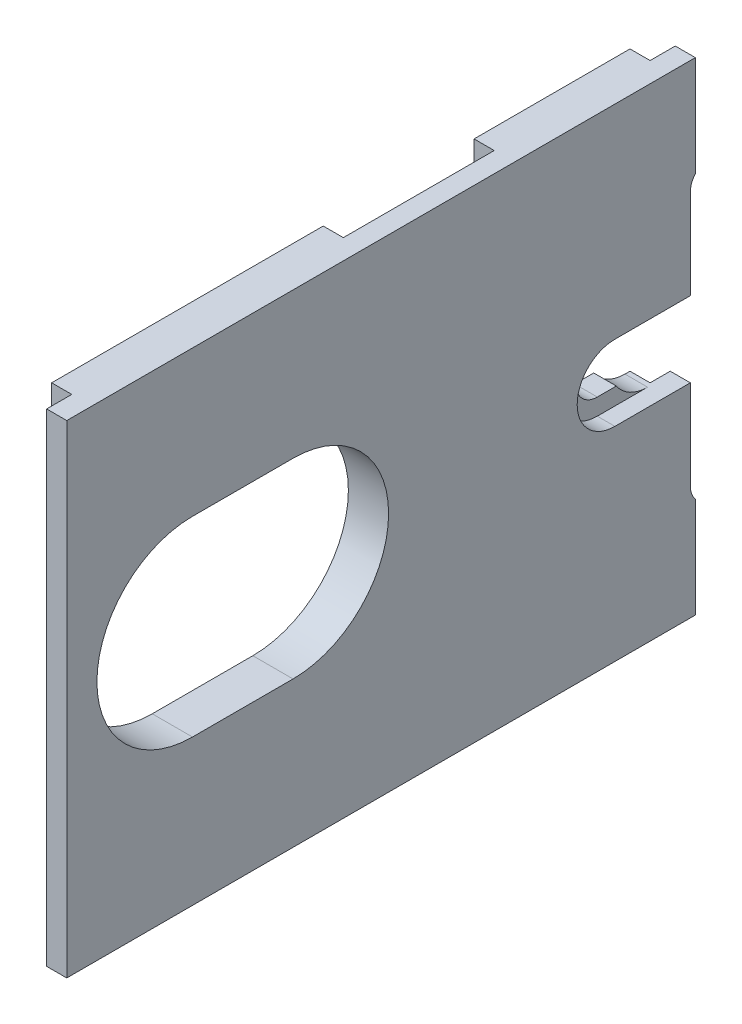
ISO-10303-21;
HEADER;
FILE_DESCRIPTION(('STEP AP214'),'2;1');
FILE_NAME('part.step','',(''),(''),'','','');
FILE_SCHEMA(('AUTOMOTIVE_DESIGN { 1 0 10303 214 1 1 1 1 }'));
ENDSEC;
DATA;
#1=APPLICATION_CONTEXT('core data for automotive mechanical design processes');
#2=APPLICATION_PROTOCOL_DEFINITION('international standard','automotive_design',2000,#1);
#3=PRODUCT_CONTEXT('',#1,'mechanical');
#4=PRODUCT('Part','Part','',(#3));
#5=PRODUCT_RELATED_PRODUCT_CATEGORY('part','',(#4));
#6=PRODUCT_DEFINITION_FORMATION('','',#4);
#7=PRODUCT_DEFINITION_CONTEXT('part definition',#1,'design');
#8=PRODUCT_DEFINITION('design','',#6,#7);
#9=PRODUCT_DEFINITION_SHAPE('','',#8);
#10=(LENGTH_UNIT() NAMED_UNIT(*) SI_UNIT(.MILLI.,.METRE.));
#11=(NAMED_UNIT(*) PLANE_ANGLE_UNIT() SI_UNIT($,.RADIAN.));
#12=(NAMED_UNIT(*) SI_UNIT($,.STERADIAN.) SOLID_ANGLE_UNIT());
#13=UNCERTAINTY_MEASURE_WITH_UNIT(LENGTH_MEASURE(1.E-05),#10,'distance_accuracy_value','');
#14=(GEOMETRIC_REPRESENTATION_CONTEXT(3) GLOBAL_UNCERTAINTY_ASSIGNED_CONTEXT((#13)) GLOBAL_UNIT_ASSIGNED_CONTEXT((#10,
#11,#12)) REPRESENTATION_CONTEXT('',''));
#15=CARTESIAN_POINT('',(0.,0.,0.));
#16=DIRECTION('',(0.,0.,1.));
#17=DIRECTION('',(1.,0.,0.));
#18=AXIS2_PLACEMENT_3D('',#15,#16,#17);
#19=CARTESIAN_POINT('',(71.5,25.354248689,-3.));
#20=DIRECTION('',(-1.,0.,0.));
#21=DIRECTION('',(0.,0.,1.));
#22=AXIS2_PLACEMENT_3D('',#19,#20,#21);
#23=CYLINDRICAL_SURFACE('',#22,4.);
#24=DIRECTION('',(-1.,0.,0.));
#25=VECTOR('',#24,1.);
#26=CARTESIAN_POINT('',(69.5,25.354248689,1.));
#27=LINE('',#26,#25);
#28=CARTESIAN_POINT('',(71.5,25.354248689,1.000000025));
#29=VERTEX_POINT('',#28);
#30=CARTESIAN_POINT('',(67.5,25.354248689,1.));
#31=VERTEX_POINT('',#30);
#32=EDGE_CURVE('E584',#29,#31,#27,.T.);
#33=ORIENTED_EDGE('',*,*,#32,.T.);
#34=CARTESIAN_POINT('',(67.5,25.354248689,-3.));
#35=DIRECTION('',(-1.,0.,0.));
#36=DIRECTION('',(0.,0.,1.));
#37=AXIS2_PLACEMENT_3D('',#34,#35,#36);
#38=CIRCLE('',#37,4.);
#39=CARTESIAN_POINT('',(67.5,28.0000000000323,0.));
#40=VERTEX_POINT('',#39);
#41=EDGE_CURVE('E348',#31,#40,#38,.T.);
#42=ORIENTED_EDGE('',*,*,#41,.T.);
#43=DIRECTION('',(1.,0.,0.));
#44=VECTOR('',#43,1.);
#45=CARTESIAN_POINT('',(69.5,28.,0.));
#46=LINE('',#45,#44);
#47=CARTESIAN_POINT('',(71.5,28.0000000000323,0.));
#48=VERTEX_POINT('',#47);
#49=EDGE_CURVE('E335',#40,#48,#46,.T.);
#50=ORIENTED_EDGE('',*,*,#49,.T.);
#51=CARTESIAN_POINT('',(71.5,25.354248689,-3.));
#52=DIRECTION('',(-1.,0.,0.));
#53=DIRECTION('',(0.,0.,1.));
#54=AXIS2_PLACEMENT_3D('',#51,#52,#53);
#55=CIRCLE('',#54,4.);
#56=EDGE_CURVE('E347',#29,#48,#55,.T.);
#57=ORIENTED_EDGE('',*,*,#56,.F.);
#58=EDGE_LOOP('',(#33,#42,#50,#57));
#59=FACE_BOUND('',#58,.T.);
#60=ADVANCED_FACE('F14',(#59),#23,.F.);
#61=CARTESIAN_POINT('',(71.5,-25.354248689,-3.));
#62=DIRECTION('',(-1.,0.,0.));
#63=DIRECTION('',(0.,0.,1.));
#64=AXIS2_PLACEMENT_3D('',#61,#62,#63);
#65=CYLINDRICAL_SURFACE('',#64,4.);
#66=DIRECTION('',(-1.,0.,0.));
#67=VECTOR('',#66,1.);
#68=CARTESIAN_POINT('',(69.5,-28.,0.));
#69=LINE('',#68,#67);
#70=CARTESIAN_POINT('',(71.5,-28.0000000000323,0.));
#71=VERTEX_POINT('',#70);
#72=CARTESIAN_POINT('',(67.5,-28.0000000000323,0.));
#73=VERTEX_POINT('',#72);
#74=EDGE_CURVE('E342',#71,#73,#69,.T.);
#75=ORIENTED_EDGE('',*,*,#74,.T.);
#76=CARTESIAN_POINT('',(67.5,-25.354248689,-3.));
#77=DIRECTION('',(-1.,0.,0.));
#78=DIRECTION('',(0.,0.,1.));
#79=AXIS2_PLACEMENT_3D('',#76,#77,#78);
#80=CIRCLE('',#79,4.);
#81=CARTESIAN_POINT('',(67.5,-25.354248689,1.));
#82=VERTEX_POINT('',#81);
#83=EDGE_CURVE('E336',#73,#82,#80,.T.);
#84=ORIENTED_EDGE('',*,*,#83,.T.);
#85=DIRECTION('',(1.,0.,0.));
#86=VECTOR('',#85,1.);
#87=CARTESIAN_POINT('',(69.5,-25.354248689,1.));
#88=LINE('',#87,#86);
#89=CARTESIAN_POINT('',(71.5,-25.354248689,1.000000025));
#90=VERTEX_POINT('',#89);
#91=EDGE_CURVE('E332',#82,#90,#88,.T.);
#92=ORIENTED_EDGE('',*,*,#91,.T.);
#93=CARTESIAN_POINT('',(71.5,-25.354248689,-3.));
#94=DIRECTION('',(-1.,0.,0.));
#95=DIRECTION('',(0.,0.,1.));
#96=AXIS2_PLACEMENT_3D('',#93,#94,#95);
#97=CIRCLE('',#96,4.);
#98=EDGE_CURVE('E365',#71,#90,#97,.T.);
#99=ORIENTED_EDGE('',*,*,#98,.F.);
#100=EDGE_LOOP('',(#75,#84,#92,#99));
#101=FACE_BOUND('',#100,.T.);
#102=ADVANCED_FACE('F832',(#101),#65,.F.);
#103=CARTESIAN_POINT('',(67.5,-7.5,1.));
#104=DIRECTION('',(0.,0.,1.));
#105=DIRECTION('',(0.,-1.,0.));
#106=AXIS2_PLACEMENT_3D('',#103,#104,#105);
#107=PLANE('',#106);
#108=ORIENTED_EDGE('',*,*,#91,.F.);
#109=DIRECTION('',(0.,1.,0.));
#110=VECTOR('',#109,1.);
#111=CARTESIAN_POINT('',(67.5,-27.75,1.));
#112=LINE('',#111,#110);
#113=CARTESIAN_POINT('',(67.5,-7.5,1.));
#114=VERTEX_POINT('',#113);
#115=EDGE_CURVE('E333',#82,#114,#112,.T.);
#116=ORIENTED_EDGE('',*,*,#115,.T.);
#117=DIRECTION('',(1.,0.,0.));
#118=VECTOR('',#117,1.);
#119=CARTESIAN_POINT('',(67.5,-7.5,1.));
#120=LINE('',#119,#118);
#121=CARTESIAN_POINT('',(71.5,-7.5,1.00000001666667));
#122=VERTEX_POINT('',#121);
#123=EDGE_CURVE('E560',#114,#122,#120,.T.);
#124=ORIENTED_EDGE('',*,*,#123,.T.);
#125=DIRECTION('',(0.,1.,0.));
#126=VECTOR('',#125,1.);
#127=CARTESIAN_POINT('',(71.5,0.,1.00000005));
#128=LINE('',#127,#126);
#129=EDGE_CURVE('E360',#90,#122,#128,.T.);
#130=ORIENTED_EDGE('',*,*,#129,.F.);
#131=EDGE_LOOP('',(#108,#116,#124,#130));
#132=FACE_BOUND('',#131,.T.);
#133=ADVANCED_FACE('F860',(#132),#107,.F.);
#134=CARTESIAN_POINT('',(67.5,25.354248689,1.));
#135=DIRECTION('',(0.,0.,1.));
#136=DIRECTION('',(0.,-1.,0.));
#137=AXIS2_PLACEMENT_3D('',#134,#135,#136);
#138=PLANE('',#137);
#139=ORIENTED_EDGE('',*,*,#32,.F.);
#140=DIRECTION('',(0.,1.,0.));
#141=VECTOR('',#140,1.);
#142=CARTESIAN_POINT('',(71.5,0.,1.00000005));
#143=LINE('',#142,#141);
#144=CARTESIAN_POINT('',(71.5,7.5,1.00000001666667));
#145=VERTEX_POINT('',#144);
#146=EDGE_CURVE('E356',#145,#29,#143,.T.);
#147=ORIENTED_EDGE('',*,*,#146,.F.);
#148=DIRECTION('',(-1.,0.,0.));
#149=VECTOR('',#148,1.);
#150=CARTESIAN_POINT('',(67.5,7.5,1.));
#151=LINE('',#150,#149);
#152=CARTESIAN_POINT('',(67.5,7.5,1.));
#153=VERTEX_POINT('',#152);
#154=EDGE_CURVE('E534',#145,#153,#151,.T.);
#155=ORIENTED_EDGE('',*,*,#154,.T.);
#156=DIRECTION('',(0.,1.,0.));
#157=VECTOR('',#156,1.);
#158=CARTESIAN_POINT('',(67.5,27.75,1.));
#159=LINE('',#158,#157);
#160=EDGE_CURVE('E351',#153,#31,#159,.T.);
#161=ORIENTED_EDGE('',*,*,#160,.T.);
#162=EDGE_LOOP('',(#139,#147,#155,#161));
#163=FACE_BOUND('',#162,.T.);
#164=ADVANCED_FACE('F714',(#163),#138,.F.);
#165=CARTESIAN_POINT('',(67.5,-48.,0.));
#166=DIRECTION('',(0.,0.,1.));
#167=DIRECTION('',(1.,0.,0.));
#168=AXIS2_PLACEMENT_3D('',#165,#166,#167);
#169=PLANE('',#168);
#170=ORIENTED_EDGE('',*,*,#74,.F.);
#171=DIRECTION('',(0.,1.,0.));
#172=VECTOR('',#171,1.);
#173=CARTESIAN_POINT('',(71.5,0.,0.));
#174=LINE('',#173,#172);
#175=CARTESIAN_POINT('',(71.5,-48.,0.));
#176=VERTEX_POINT('',#175);
#177=EDGE_CURVE('E368',#176,#71,#174,.T.);
#178=ORIENTED_EDGE('',*,*,#177,.F.);
#179=DIRECTION('',(-1.,0.,0.));
#180=VECTOR('',#179,1.);
#181=CARTESIAN_POINT('',(67.5,-48.,0.));
#182=LINE('',#181,#180);
#183=CARTESIAN_POINT('',(67.5,-48.,0.));
#184=VERTEX_POINT('',#183);
#185=EDGE_CURVE('E589',#176,#184,#182,.T.);
#186=ORIENTED_EDGE('',*,*,#185,.T.);
#187=DIRECTION('',(0.,1.,0.));
#188=VECTOR('',#187,1.);
#189=CARTESIAN_POINT('',(67.5,-27.75,0.));
#190=LINE('',#189,#188);
#191=EDGE_CURVE('E339',#184,#73,#190,.T.);
#192=ORIENTED_EDGE('',*,*,#191,.T.);
#193=EDGE_LOOP('',(#170,#178,#186,#192));
#194=FACE_BOUND('',#193,.T.);
#195=ADVANCED_FACE('F827',(#194),#169,.F.);
#196=CARTESIAN_POINT('',(67.5,-48.,36.));
#197=DIRECTION('',(1.,0.,0.));
#198=DIRECTION('',(0.,1.,0.));
#199=AXIS2_PLACEMENT_3D('',#196,#197,#198);
#200=PLANE('',#199);
#201=DIRECTION('',(0.,1.,0.));
#202=VECTOR('',#201,1.);
#203=CARTESIAN_POINT('',(67.5,-36.5,66.));
#204=LINE('',#203,#202);
#205=CARTESIAN_POINT('',(67.5,-48.,65.9999999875));
#206=VERTEX_POINT('',#205);
#207=CARTESIAN_POINT('',(67.5,-24.9999999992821,66.));
#208=VERTEX_POINT('',#207);
#209=EDGE_CURVE('E527',#206,#208,#204,.T.);
#210=ORIENTED_EDGE('',*,*,#209,.T.);
#211=CARTESIAN_POINT('',(67.5,-25.,59.));
#212=DIRECTION('',(-1.,0.,0.));
#213=DIRECTION('',(0.,0.,1.));
#214=AXIS2_PLACEMENT_3D('',#211,#212,#213);
#215=CIRCLE('',#214,7.);
#216=CARTESIAN_POINT('',(67.5,-18.,59.));
#217=VERTEX_POINT('',#216);
#218=EDGE_CURVE('E508',#217,#208,#215,.F.);
#219=ORIENTED_EDGE('',*,*,#218,.F.);
#220=DIRECTION('',(0.,0.,-1.));
#221=VECTOR('',#220,1.);
#222=CARTESIAN_POINT('',(67.5,-18.,51.));
#223=LINE('',#222,#221);
#224=CARTESIAN_POINT('',(67.5,-18.,42.9999999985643));
#225=VERTEX_POINT('',#224);
#226=EDGE_CURVE('E504',#217,#225,#223,.T.);
#227=ORIENTED_EDGE('',*,*,#226,.T.);
#228=CARTESIAN_POINT('',(67.5,-25.,43.));
#229=DIRECTION('',(-1.,0.,0.));
#230=DIRECTION('',(0.,0.,1.));
#231=AXIS2_PLACEMENT_3D('',#228,#229,#230);
#232=CIRCLE('',#231,7.);
#233=CARTESIAN_POINT('',(67.5,-25.,36.));
#234=VERTEX_POINT('',#233);
#235=EDGE_CURVE('E500',#234,#225,#232,.F.);
#236=ORIENTED_EDGE('',*,*,#235,.F.);
#237=DIRECTION('',(0.,-1.,0.));
#238=VECTOR('',#237,1.);
#239=CARTESIAN_POINT('',(67.5,-36.5,36.));
#240=LINE('',#239,#238);
#241=CARTESIAN_POINT('',(67.5,-48.,36.000000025));
#242=VERTEX_POINT('',#241);
#243=EDGE_CURVE('E485',#234,#242,#240,.T.);
#244=ORIENTED_EDGE('',*,*,#243,.T.);
#245=DIRECTION('',(0.,0.,1.));
#246=VECTOR('',#245,1.);
#247=CARTESIAN_POINT('',(67.5,-48.,87.5));
#248=LINE('',#247,#246);
#249=EDGE_CURVE('E490',#242,#206,#248,.T.);
#250=ORIENTED_EDGE('',*,*,#249,.T.);
#251=EDGE_LOOP('',(#210,#219,#227,#236,#244,#250));
#252=FACE_BOUND('',#251,.T.);
#253=ADVANCED_FACE('F867',(#252),#200,.F.);
#254=CARTESIAN_POINT('',(67.5,-48.,0.));
#255=DIRECTION('',(1.,0.,0.));
#256=DIRECTION('',(0.,1.,0.));
#257=AXIS2_PLACEMENT_3D('',#254,#255,#256);
#258=PLANE('',#257);
#259=ORIENTED_EDGE('',*,*,#115,.F.);
#260=ORIENTED_EDGE('',*,*,#83,.F.);
#261=ORIENTED_EDGE('',*,*,#191,.F.);
#262=DIRECTION('',(0.,0.,1.));
#263=VECTOR('',#262,1.);
#264=CARTESIAN_POINT('',(67.5,-48.,87.5));
#265=LINE('',#264,#263);
#266=CARTESIAN_POINT('',(67.5,-48.,5.0000000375));
#267=VERTEX_POINT('',#266);
#268=EDGE_CURVE('E491',#184,#267,#265,.T.);
#269=ORIENTED_EDGE('',*,*,#268,.T.);
#270=DIRECTION('',(0.,1.,0.));
#271=VECTOR('',#270,1.);
#272=CARTESIAN_POINT('',(67.5,-27.75,5.));
#273=LINE('',#272,#271);
#274=CARTESIAN_POINT('',(67.5,-7.5,5.0000000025));
#275=VERTEX_POINT('',#274);
#276=EDGE_CURVE('E381',#267,#275,#273,.T.);
#277=ORIENTED_EDGE('',*,*,#276,.T.);
#278=DIRECTION('',(0.,0.,-1.));
#279=VECTOR('',#278,1.);
#280=CARTESIAN_POINT('',(67.5,-7.5,8.5));
#281=LINE('',#280,#279);
#282=EDGE_CURVE('E564',#275,#114,#281,.T.);
#283=ORIENTED_EDGE('',*,*,#282,.T.);
#284=EDGE_LOOP('',(#259,#260,#261,#269,#277,#283));
#285=FACE_BOUND('',#284,.T.);
#286=ADVANCED_FACE('F870',(#285),#258,.F.);
#287=CARTESIAN_POINT('',(67.5,28.,0.));
#288=DIRECTION('',(0.,0.,1.));
#289=DIRECTION('',(1.,0.,0.));
#290=AXIS2_PLACEMENT_3D('',#287,#288,#289);
#291=PLANE('',#290);
#292=ORIENTED_EDGE('',*,*,#49,.F.);
#293=DIRECTION('',(0.,1.,0.));
#294=VECTOR('',#293,1.);
#295=CARTESIAN_POINT('',(67.5,27.75,0.));
#296=LINE('',#295,#294);
#297=CARTESIAN_POINT('',(67.5,48.,0.));
#298=VERTEX_POINT('',#297);
#299=EDGE_CURVE('E345',#40,#298,#296,.T.);
#300=ORIENTED_EDGE('',*,*,#299,.T.);
#301=DIRECTION('',(-1.,0.,0.));
#302=VECTOR('',#301,1.);
#303=CARTESIAN_POINT('',(67.5,48.,0.));
#304=LINE('',#303,#302);
#305=CARTESIAN_POINT('',(71.5,48.,0.));
#306=VERTEX_POINT('',#305);
#307=EDGE_CURVE('E518',#306,#298,#304,.T.);
#308=ORIENTED_EDGE('',*,*,#307,.F.);
#309=DIRECTION('',(0.,1.,0.));
#310=VECTOR('',#309,1.);
#311=CARTESIAN_POINT('',(71.5,0.,0.));
#312=LINE('',#311,#310);
#313=EDGE_CURVE('E371',#48,#306,#312,.T.);
#314=ORIENTED_EDGE('',*,*,#313,.F.);
#315=EDGE_LOOP('',(#292,#300,#308,#314));
#316=FACE_BOUND('',#315,.T.);
#317=ADVANCED_FACE('F638',(#316),#291,.F.);
#318=CARTESIAN_POINT('',(67.5,7.5,0.));
#319=DIRECTION('',(1.,0.,0.));
#320=DIRECTION('',(0.,1.,0.));
#321=AXIS2_PLACEMENT_3D('',#318,#319,#320);
#322=PLANE('',#321);
#323=ORIENTED_EDGE('',*,*,#41,.F.);
#324=ORIENTED_EDGE('',*,*,#160,.F.);
#325=DIRECTION('',(0.,0.,1.));
#326=VECTOR('',#325,1.);
#327=CARTESIAN_POINT('',(67.5,7.5,8.5));
#328=LINE('',#327,#326);
#329=CARTESIAN_POINT('',(67.5,7.5,5.00000000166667));
#330=VERTEX_POINT('',#329);
#331=EDGE_CURVE('E531',#153,#330,#328,.T.);
#332=ORIENTED_EDGE('',*,*,#331,.T.);
#333=DIRECTION('',(0.,1.,0.));
#334=VECTOR('',#333,1.);
#335=CARTESIAN_POINT('',(67.5,27.75,5.));
#336=LINE('',#335,#334);
#337=CARTESIAN_POINT('',(67.5,48.,5.00000005));
#338=VERTEX_POINT('',#337);
#339=EDGE_CURVE('E474',#330,#338,#336,.T.);
#340=ORIENTED_EDGE('',*,*,#339,.T.);
#341=DIRECTION('',(0.,0.,1.));
#342=VECTOR('',#341,1.);
#343=CARTESIAN_POINT('',(67.5,48.,87.5));
#344=LINE('',#343,#342);
#345=EDGE_CURVE('E464',#298,#338,#344,.T.);
#346=ORIENTED_EDGE('',*,*,#345,.F.);
#347=ORIENTED_EDGE('',*,*,#299,.F.);
#348=EDGE_LOOP('',(#323,#324,#332,#340,#346,#347));
#349=FACE_BOUND('',#348,.T.);
#350=ADVANCED_FACE('F641',(#349),#322,.F.);
#351=CARTESIAN_POINT('',(67.5,48.,36.));
#352=DIRECTION('',(-1.,0.,0.));
#353=DIRECTION('',(0.,-1.,0.));
#354=AXIS2_PLACEMENT_3D('',#351,#352,#353);
#355=PLANE('',#354);
#356=DIRECTION('',(0.,0.,1.));
#357=VECTOR('',#356,1.);
#358=CARTESIAN_POINT('',(67.5,48.,87.5));
#359=LINE('',#358,#357);
#360=CARTESIAN_POINT('',(67.5,48.,36.0000000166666));
#361=VERTEX_POINT('',#360);
#362=CARTESIAN_POINT('',(67.5,48.,65.9999999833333));
#363=VERTEX_POINT('',#362);
#364=EDGE_CURVE('E658',#361,#363,#359,.T.);
#365=ORIENTED_EDGE('',*,*,#364,.F.);
#366=DIRECTION('',(0.,-1.,0.));
#367=VECTOR('',#366,1.);
#368=CARTESIAN_POINT('',(67.5,36.5,36.));
#369=LINE('',#368,#367);
#370=CARTESIAN_POINT('',(67.5,25.0000000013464,36.));
#371=VERTEX_POINT('',#370);
#372=EDGE_CURVE('E451',#361,#371,#369,.T.);
#373=ORIENTED_EDGE('',*,*,#372,.T.);
#374=CARTESIAN_POINT('',(67.5,25.,43.));
#375=DIRECTION('',(-1.,0.,0.));
#376=DIRECTION('',(0.,0.,1.));
#377=AXIS2_PLACEMENT_3D('',#374,#375,#376);
#378=CIRCLE('',#377,7.);
#379=CARTESIAN_POINT('',(67.5,18.,42.9999999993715));
#380=VERTEX_POINT('',#379);
#381=EDGE_CURVE('E447',#380,#371,#378,.F.);
#382=ORIENTED_EDGE('',*,*,#381,.F.);
#383=DIRECTION('',(0.,0.,1.));
#384=VECTOR('',#383,1.);
#385=CARTESIAN_POINT('',(67.5,18.,51.));
#386=LINE('',#385,#384);
#387=CARTESIAN_POINT('',(67.5,18.,59.));
#388=VERTEX_POINT('',#387);
#389=EDGE_CURVE('E533',#380,#388,#386,.T.);
#390=ORIENTED_EDGE('',*,*,#389,.T.);
#391=CARTESIAN_POINT('',(67.5,25.,59.));
#392=DIRECTION('',(-1.,0.,0.));
#393=DIRECTION('',(0.,0.,1.));
#394=AXIS2_PLACEMENT_3D('',#391,#392,#393);
#395=CIRCLE('',#394,7.);
#396=CARTESIAN_POINT('',(67.5,25.,66.));
#397=VERTEX_POINT('',#396);
#398=EDGE_CURVE('E619',#397,#388,#395,.F.);
#399=ORIENTED_EDGE('',*,*,#398,.F.);
#400=DIRECTION('',(0.,1.,0.));
#401=VECTOR('',#400,1.);
#402=CARTESIAN_POINT('',(67.5,36.5,66.));
#403=LINE('',#402,#401);
#404=EDGE_CURVE('E525',#397,#363,#403,.T.);
#405=ORIENTED_EDGE('',*,*,#404,.T.);
#406=EDGE_LOOP('',(#365,#373,#382,#390,#399,#405));
#407=FACE_BOUND('',#406,.T.);
#408=ADVANCED_FACE('F738',(#407),#355,.T.);
#409=CARTESIAN_POINT('',(71.5,-48.,0.));
#410=DIRECTION('',(1.,0.,0.));
#411=DIRECTION('',(0.,1.,0.));
#412=AXIS2_PLACEMENT_3D('',#409,#410,#411);
#413=PLANE('',#412);
#414=CARTESIAN_POINT('',(71.5,0.,80.));
#415=DIRECTION('',(1.,0.,0.));
#416=DIRECTION('',(0.,0.,-1.));
#417=AXIS2_PLACEMENT_3D('',#414,#415,#416);
#418=CIRCLE('',#417,19.);
#419=CARTESIAN_POINT('',(71.5,-19.,80.));
#420=VERTEX_POINT('',#419);
#421=CARTESIAN_POINT('',(71.5,19.,80.));
#422=VERTEX_POINT('',#421);
#423=EDGE_CURVE('E307',#420,#422,#418,.T.);
#424=ORIENTED_EDGE('',*,*,#423,.F.);
#425=DIRECTION('',(0.,0.,-1.));
#426=VECTOR('',#425,1.);
#427=CARTESIAN_POINT('',(71.5,-19.,0.));
#428=LINE('',#427,#426);
#429=CARTESIAN_POINT('',(71.5,-19.,100.));
#430=VERTEX_POINT('',#429);
#431=EDGE_CURVE('E300',#430,#420,#428,.T.);
#432=ORIENTED_EDGE('',*,*,#431,.F.);
#433=CARTESIAN_POINT('',(71.5,0.,100.));
#434=DIRECTION('',(1.,0.,0.));
#435=DIRECTION('',(0.,0.,-1.));
#436=AXIS2_PLACEMENT_3D('',#433,#434,#435);
#437=CIRCLE('',#436,19.);
#438=CARTESIAN_POINT('',(71.5,19.,100.));
#439=VERTEX_POINT('',#438);
#440=EDGE_CURVE('E280',#439,#430,#437,.T.);
#441=ORIENTED_EDGE('',*,*,#440,.F.);
#442=DIRECTION('',(0.,0.,1.));
#443=VECTOR('',#442,1.);
#444=CARTESIAN_POINT('',(71.5,19.,0.));
#445=LINE('',#444,#443);
#446=EDGE_CURVE('E305',#422,#439,#445,.T.);
#447=ORIENTED_EDGE('',*,*,#446,.F.);
#448=EDGE_LOOP('',(#424,#432,#441,#447));
#449=FACE_BOUND('',#448,.T.);
#450=DIRECTION('',(0.,1.,0.));
#451=VECTOR('',#450,1.);
#452=CARTESIAN_POINT('',(71.5,-48.0001033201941,125.));
#453=LINE('',#452,#451);
#454=CARTESIAN_POINT('',(71.5,-48.,125.));
#455=VERTEX_POINT('',#454);
#456=CARTESIAN_POINT('',(71.5,48.,125.));
#457=VERTEX_POINT('',#456);
#458=EDGE_CURVE('E317',#455,#457,#453,.T.);
#459=ORIENTED_EDGE('',*,*,#458,.F.);
#460=DIRECTION('',(0.,0.,-1.));
#461=VECTOR('',#460,1.);
#462=CARTESIAN_POINT('',(71.5,-48.,87.5));
#463=LINE('',#462,#461);
#464=EDGE_CURVE('E18',#455,#176,#463,.T.);
#465=ORIENTED_EDGE('',*,*,#464,.T.);
#466=ORIENTED_EDGE('',*,*,#177,.T.);
#467=ORIENTED_EDGE('',*,*,#98,.T.);
#468=ORIENTED_EDGE('',*,*,#129,.T.);
#469=DIRECTION('',(0.,0.,1.));
#470=VECTOR('',#469,1.);
#471=CARTESIAN_POINT('',(71.5,-7.5,8.5));
#472=LINE('',#471,#470);
#473=CARTESIAN_POINT('',(71.5,-7.5,15.9999999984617));
#474=VERTEX_POINT('',#473);
#475=EDGE_CURVE('E557',#122,#474,#472,.T.);
#476=ORIENTED_EDGE('',*,*,#475,.T.);
#477=CARTESIAN_POINT('',(71.5,0.,16.));
#478=DIRECTION('',(1.,0.,0.));
#479=DIRECTION('',(0.,0.,-1.));
#480=AXIS2_PLACEMENT_3D('',#477,#478,#479);
#481=CIRCLE('',#480,7.5);
#482=CARTESIAN_POINT('',(71.5,7.5,16.));
#483=VERTEX_POINT('',#482);
#484=EDGE_CURVE('E559',#483,#474,#481,.T.);
#485=ORIENTED_EDGE('',*,*,#484,.F.);
#486=DIRECTION('',(0.,0.,-1.));
#487=VECTOR('',#486,1.);
#488=CARTESIAN_POINT('',(71.5,7.5,8.5));
#489=LINE('',#488,#487);
#490=EDGE_CURVE('E549',#483,#145,#489,.T.);
#491=ORIENTED_EDGE('',*,*,#490,.T.);
#492=ORIENTED_EDGE('',*,*,#146,.T.);
#493=ORIENTED_EDGE('',*,*,#56,.T.);
#494=ORIENTED_EDGE('',*,*,#313,.T.);
#495=DIRECTION('',(0.,0.,-1.));
#496=VECTOR('',#495,1.);
#497=CARTESIAN_POINT('',(71.5,48.,87.5));
#498=LINE('',#497,#496);
#499=EDGE_CURVE('E516',#457,#306,#498,.T.);
#500=ORIENTED_EDGE('',*,*,#499,.F.);
#501=EDGE_LOOP('',(#459,#465,#466,#467,#468,#476,#485,#491,#492,#493,#494,#500));
#502=FACE_BOUND('',#501,.T.);
#503=ADVANCED_FACE('F712',(#449,#502),#413,.T.);
#504=CARTESIAN_POINT('',(63.5,-7.5,1.));
#505=DIRECTION('',(0.,-1.,0.));
#506=DIRECTION('',(1.,0.,0.));
#507=AXIS2_PLACEMENT_3D('',#504,#505,#506);
#508=PLANE('',#507);
#509=ORIENTED_EDGE('',*,*,#123,.F.);
#510=ORIENTED_EDGE('',*,*,#282,.F.);
#511=DIRECTION('',(-1.,0.,0.));
#512=VECTOR('',#511,1.);
#513=CARTESIAN_POINT('',(65.5,-7.5,5.));
#514=LINE('',#513,#512);
#515=CARTESIAN_POINT('',(63.5,-7.5,5.0000000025));
#516=VERTEX_POINT('',#515);
#517=EDGE_CURVE('E382',#275,#516,#514,.T.);
#518=ORIENTED_EDGE('',*,*,#517,.T.);
#519=DIRECTION('',(0.,0.,-1.));
#520=VECTOR('',#519,1.);
#521=CARTESIAN_POINT('',(63.5,-7.5,8.5));
#522=LINE('',#521,#520);
#523=CARTESIAN_POINT('',(63.5,-7.5,5.99999999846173));
#524=VERTEX_POINT('',#523);
#525=EDGE_CURVE('E359',#524,#516,#522,.T.);
#526=ORIENTED_EDGE('',*,*,#525,.F.);
#527=DIRECTION('',(1.,0.,0.));
#528=VECTOR('',#527,1.);
#529=CARTESIAN_POINT('',(65.75,-7.5,5.99999999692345));
#530=LINE('',#529,#528);
#531=CARTESIAN_POINT('',(68.,-7.5,5.99999999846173));
#532=VERTEX_POINT('',#531);
#533=EDGE_CURVE('E390',#532,#524,#530,.F.);
#534=ORIENTED_EDGE('',*,*,#533,.F.);
#535=DIRECTION('',(0.,0.,1.));
#536=VECTOR('',#535,1.);
#537=CARTESIAN_POINT('',(68.,-7.5,14.75));
#538=LINE('',#537,#536);
#539=CARTESIAN_POINT('',(68.,-7.5,15.9999999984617));
#540=VERTEX_POINT('',#539);
#541=EDGE_CURVE('E388',#532,#540,#538,.T.);
#542=ORIENTED_EDGE('',*,*,#541,.T.);
#543=DIRECTION('',(1.,0.,0.));
#544=VECTOR('',#543,1.);
#545=CARTESIAN_POINT('',(69.75,-7.5,15.9999999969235));
#546=LINE('',#545,#544);
#547=EDGE_CURVE('E625',#474,#540,#546,.F.);
#548=ORIENTED_EDGE('',*,*,#547,.F.);
#549=ORIENTED_EDGE('',*,*,#475,.F.);
#550=EDGE_LOOP('',(#509,#510,#518,#526,#534,#542,#548,#549));
#551=FACE_BOUND('',#550,.T.);
#552=ADVANCED_FACE('F792',(#551),#508,.F.);
#553=CARTESIAN_POINT('',(68.,0.,16.));
#554=DIRECTION('',(1.,0.,0.));
#555=DIRECTION('',(0.,0.,-1.));
#556=AXIS2_PLACEMENT_3D('',#553,#554,#555);
#557=CYLINDRICAL_SURFACE('',#556,7.5);
#558=ORIENTED_EDGE('',*,*,#547,.T.);
#559=CARTESIAN_POINT('',(68.,0.,16.));
#560=DIRECTION('',(1.,0.,0.));
#561=DIRECTION('',(0.,0.,-1.));
#562=AXIS2_PLACEMENT_3D('',#559,#560,#561);
#563=CIRCLE('',#562,7.5);
#564=CARTESIAN_POINT('',(68.,7.5,16.));
#565=VERTEX_POINT('',#564);
#566=EDGE_CURVE('E387',#540,#565,#563,.F.);
#567=ORIENTED_EDGE('',*,*,#566,.T.);
#568=DIRECTION('',(1.,0.,0.));
#569=VECTOR('',#568,1.);
#570=CARTESIAN_POINT('',(67.5,7.5,16.));
#571=LINE('',#570,#569);
#572=EDGE_CURVE('E554',#565,#483,#571,.T.);
#573=ORIENTED_EDGE('',*,*,#572,.T.);
#574=ORIENTED_EDGE('',*,*,#484,.T.);
#575=EDGE_LOOP('',(#558,#567,#573,#574));
#576=FACE_BOUND('',#575,.T.);
#577=ADVANCED_FACE('F757',(#576),#557,.F.);
#578=CARTESIAN_POINT('',(71.5,7.5,1.));
#579=DIRECTION('',(0.,1.,0.));
#580=DIRECTION('',(-1.,0.,0.));
#581=AXIS2_PLACEMENT_3D('',#578,#579,#580);
#582=PLANE('',#581);
#583=ORIENTED_EDGE('',*,*,#154,.F.);
#584=ORIENTED_EDGE('',*,*,#490,.F.);
#585=ORIENTED_EDGE('',*,*,#572,.F.);
#586=DIRECTION('',(0.,0.,-1.));
#587=VECTOR('',#586,1.);
#588=CARTESIAN_POINT('',(68.,7.5,14.75));
#589=LINE('',#588,#587);
#590=CARTESIAN_POINT('',(68.,7.5,6.));
#591=VERTEX_POINT('',#590);
#592=EDGE_CURVE('E383',#565,#591,#589,.T.);
#593=ORIENTED_EDGE('',*,*,#592,.T.);
#594=DIRECTION('',(-1.,0.,0.));
#595=VECTOR('',#594,1.);
#596=CARTESIAN_POINT('',(65.75,7.5,6.));
#597=LINE('',#596,#595);
#598=CARTESIAN_POINT('',(63.5,7.5,6.));
#599=VERTEX_POINT('',#598);
#600=EDGE_CURVE('E477',#599,#591,#597,.F.);
#601=ORIENTED_EDGE('',*,*,#600,.F.);
#602=DIRECTION('',(0.,0.,1.));
#603=VECTOR('',#602,1.);
#604=CARTESIAN_POINT('',(63.5,7.5,8.5));
#605=LINE('',#604,#603);
#606=CARTESIAN_POINT('',(63.5,7.5,5.00000000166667));
#607=VERTEX_POINT('',#606);
#608=EDGE_CURVE('E672',#607,#599,#605,.T.);
#609=ORIENTED_EDGE('',*,*,#608,.F.);
#610=DIRECTION('',(1.,0.,0.));
#611=VECTOR('',#610,1.);
#612=CARTESIAN_POINT('',(65.5,7.5,5.));
#613=LINE('',#612,#611);
#614=EDGE_CURVE('E471',#607,#330,#613,.T.);
#615=ORIENTED_EDGE('',*,*,#614,.T.);
#616=ORIENTED_EDGE('',*,*,#331,.F.);
#617=EDGE_LOOP('',(#583,#584,#585,#593,#601,#609,#615,#616));
#618=FACE_BOUND('',#617,.T.);
#619=ADVANCED_FACE('F718',(#618),#582,.F.);
#620=CARTESIAN_POINT('',(63.5,18.,43.));
#621=DIRECTION('',(0.,-1.,0.));
#622=DIRECTION('',(1.,0.,0.));
#623=AXIS2_PLACEMENT_3D('',#620,#621,#622);
#624=PLANE('',#623);
#625=DIRECTION('',(1.,0.,0.));
#626=VECTOR('',#625,1.);
#627=CARTESIAN_POINT('',(65.5,18.,59.));
#628=LINE('',#627,#626);
#629=CARTESIAN_POINT('',(63.5,18.,59.));
#630=VERTEX_POINT('',#629);
#631=EDGE_CURVE('E622',#388,#630,#628,.F.);
#632=ORIENTED_EDGE('',*,*,#631,.F.);
#633=ORIENTED_EDGE('',*,*,#389,.F.);
#634=DIRECTION('',(-1.,0.,0.));
#635=VECTOR('',#634,1.);
#636=CARTESIAN_POINT('',(65.5,18.,42.9999999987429));
#637=LINE('',#636,#635);
#638=CARTESIAN_POINT('',(63.5,18.,42.9999999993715));
#639=VERTEX_POINT('',#638);
#640=EDGE_CURVE('E448',#639,#380,#637,.F.);
#641=ORIENTED_EDGE('',*,*,#640,.F.);
#642=DIRECTION('',(0.,0.,1.));
#643=VECTOR('',#642,1.);
#644=CARTESIAN_POINT('',(63.5,18.,87.5));
#645=LINE('',#644,#643);
#646=EDGE_CURVE('E417',#639,#630,#645,.T.);
#647=ORIENTED_EDGE('',*,*,#646,.T.);
#648=EDGE_LOOP('',(#632,#633,#641,#647));
#649=FACE_BOUND('',#648,.T.);
#650=ADVANCED_FACE('F747',(#649),#624,.F.);
#651=CARTESIAN_POINT('',(67.5,25.,59.));
#652=DIRECTION('',(-1.,0.,0.));
#653=DIRECTION('',(0.,0.,1.));
#654=AXIS2_PLACEMENT_3D('',#651,#652,#653);
#655=CYLINDRICAL_SURFACE('',#654,7.);
#656=ORIENTED_EDGE('',*,*,#398,.T.);
#657=ORIENTED_EDGE('',*,*,#631,.T.);
#658=CARTESIAN_POINT('',(63.5,25.,59.));
#659=DIRECTION('',(-1.,0.,0.));
#660=DIRECTION('',(0.,0.,1.));
#661=AXIS2_PLACEMENT_3D('',#658,#659,#660);
#662=CIRCLE('',#661,7.);
#663=CARTESIAN_POINT('',(63.5,25.,66.000000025));
#664=VERTEX_POINT('',#663);
#665=EDGE_CURVE('E414',#630,#664,#662,.T.);
#666=ORIENTED_EDGE('',*,*,#665,.T.);
#667=DIRECTION('',(1.,0.,0.));
#668=VECTOR('',#667,1.);
#669=CARTESIAN_POINT('',(65.5,25.,66.));
#670=LINE('',#669,#668);
#671=EDGE_CURVE('E528',#664,#397,#670,.T.);
#672=ORIENTED_EDGE('',*,*,#671,.T.);
#673=EDGE_LOOP('',(#656,#657,#666,#672));
#674=FACE_BOUND('',#673,.T.);
#675=ADVANCED_FACE('F745',(#674),#655,.F.);
#676=CARTESIAN_POINT('',(63.5,48.,66.));
#677=DIRECTION('',(0.,0.,1.));
#678=DIRECTION('',(0.,-1.,0.));
#679=AXIS2_PLACEMENT_3D('',#676,#677,#678);
#680=PLANE('',#679);
#681=DIRECTION('',(-1.,0.,0.));
#682=VECTOR('',#681,1.);
#683=CARTESIAN_POINT('',(67.5,48.,65.999999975));
#684=LINE('',#683,#682);
#685=CARTESIAN_POINT('',(63.5,48.,66.000000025));
#686=VERTEX_POINT('',#685);
#687=EDGE_CURVE('E519',#363,#686,#684,.T.);
#688=ORIENTED_EDGE('',*,*,#687,.F.);
#689=ORIENTED_EDGE('',*,*,#404,.F.);
#690=ORIENTED_EDGE('',*,*,#671,.F.);
#691=DIRECTION('',(0.,1.,0.));
#692=VECTOR('',#691,1.);
#693=CARTESIAN_POINT('',(63.5,0.,66.00000005));
#694=LINE('',#693,#692);
#695=EDGE_CURVE('E411',#664,#686,#694,.T.);
#696=ORIENTED_EDGE('',*,*,#695,.T.);
#697=EDGE_LOOP('',(#688,#689,#690,#696));
#698=FACE_BOUND('',#697,.T.);
#699=ADVANCED_FACE('F743',(#698),#680,.F.);
#700=CARTESIAN_POINT('',(63.5,-25.,66.));
#701=DIRECTION('',(0.,0.,1.));
#702=DIRECTION('',(0.,-1.,0.));
#703=AXIS2_PLACEMENT_3D('',#700,#701,#702);
#704=PLANE('',#703);
#705=DIRECTION('',(1.,0.,0.));
#706=VECTOR('',#705,1.);
#707=CARTESIAN_POINT('',(65.5,-24.9999999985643,66.));
#708=LINE('',#707,#706);
#709=CARTESIAN_POINT('',(63.5,-24.9999999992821,66.000000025));
#710=VERTEX_POINT('',#709);
#711=EDGE_CURVE('E505',#208,#710,#708,.F.);
#712=ORIENTED_EDGE('',*,*,#711,.F.);
#713=ORIENTED_EDGE('',*,*,#209,.F.);
#714=DIRECTION('',(-1.,0.,0.));
#715=VECTOR('',#714,1.);
#716=CARTESIAN_POINT('',(67.5,-48.,65.999999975));
#717=LINE('',#716,#715);
#718=CARTESIAN_POINT('',(63.5,-48.,66.000000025));
#719=VERTEX_POINT('',#718);
#720=EDGE_CURVE('E511',#206,#719,#717,.T.);
#721=ORIENTED_EDGE('',*,*,#720,.T.);
#722=DIRECTION('',(0.,1.,0.));
#723=VECTOR('',#722,1.);
#724=CARTESIAN_POINT('',(63.5,0.,66.00000005));
#725=LINE('',#724,#723);
#726=EDGE_CURVE('E406',#719,#710,#725,.T.);
#727=ORIENTED_EDGE('',*,*,#726,.T.);
#728=EDGE_LOOP('',(#712,#713,#721,#727));
#729=FACE_BOUND('',#728,.T.);
#730=ADVANCED_FACE('F824',(#729),#704,.F.);
#731=CARTESIAN_POINT('',(67.5,-25.,59.));
#732=DIRECTION('',(-1.,0.,0.));
#733=DIRECTION('',(0.,0.,1.));
#734=AXIS2_PLACEMENT_3D('',#731,#732,#733);
#735=CYLINDRICAL_SURFACE('',#734,7.);
#736=ORIENTED_EDGE('',*,*,#218,.T.);
#737=ORIENTED_EDGE('',*,*,#711,.T.);
#738=CARTESIAN_POINT('',(63.5,-25.,59.));
#739=DIRECTION('',(-1.,0.,0.));
#740=DIRECTION('',(0.,0.,1.));
#741=AXIS2_PLACEMENT_3D('',#738,#739,#740);
#742=CIRCLE('',#741,7.);
#743=CARTESIAN_POINT('',(63.5,-18.,59.));
#744=VERTEX_POINT('',#743);
#745=EDGE_CURVE('E405',#710,#744,#742,.T.);
#746=ORIENTED_EDGE('',*,*,#745,.T.);
#747=DIRECTION('',(1.,0.,0.));
#748=VECTOR('',#747,1.);
#749=CARTESIAN_POINT('',(65.5,-18.,59.));
#750=LINE('',#749,#748);
#751=EDGE_CURVE('E501',#744,#217,#750,.T.);
#752=ORIENTED_EDGE('',*,*,#751,.T.);
#753=EDGE_LOOP('',(#736,#737,#746,#752));
#754=FACE_BOUND('',#753,.T.);
#755=ADVANCED_FACE('F821',(#754),#735,.F.);
#756=CARTESIAN_POINT('',(67.5,-18.,43.));
#757=DIRECTION('',(0.,1.,0.));
#758=DIRECTION('',(-1.,0.,0.));
#759=AXIS2_PLACEMENT_3D('',#756,#757,#758);
#760=PLANE('',#759);
#761=DIRECTION('',(1.,0.,0.));
#762=VECTOR('',#761,1.);
#763=CARTESIAN_POINT('',(65.5,-18.,42.9999999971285));
#764=LINE('',#763,#762);
#765=CARTESIAN_POINT('',(63.5,-18.,42.9999999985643));
#766=VERTEX_POINT('',#765);
#767=EDGE_CURVE('E486',#225,#766,#764,.F.);
#768=ORIENTED_EDGE('',*,*,#767,.F.);
#769=ORIENTED_EDGE('',*,*,#226,.F.);
#770=ORIENTED_EDGE('',*,*,#751,.F.);
#771=DIRECTION('',(0.,0.,-1.));
#772=VECTOR('',#771,1.);
#773=CARTESIAN_POINT('',(63.5,-18.,87.5));
#774=LINE('',#773,#772);
#775=EDGE_CURVE('E403',#744,#766,#774,.T.);
#776=ORIENTED_EDGE('',*,*,#775,.T.);
#777=EDGE_LOOP('',(#768,#769,#770,#776));
#778=FACE_BOUND('',#777,.T.);
#779=ADVANCED_FACE('F818',(#778),#760,.F.);
#780=CARTESIAN_POINT('',(67.5,-25.,43.));
#781=DIRECTION('',(-1.,0.,0.));
#782=DIRECTION('',(0.,0.,1.));
#783=AXIS2_PLACEMENT_3D('',#780,#781,#782);
#784=CYLINDRICAL_SURFACE('',#783,7.);
#785=ORIENTED_EDGE('',*,*,#235,.T.);
#786=ORIENTED_EDGE('',*,*,#767,.T.);
#787=CARTESIAN_POINT('',(63.5,-25.,43.));
#788=DIRECTION('',(-1.,0.,0.));
#789=DIRECTION('',(0.,0.,1.));
#790=AXIS2_PLACEMENT_3D('',#787,#788,#789);
#791=CIRCLE('',#790,7.);
#792=CARTESIAN_POINT('',(63.5,-25.,36.00000001));
#793=VERTEX_POINT('',#792);
#794=EDGE_CURVE('E400',#766,#793,#791,.T.);
#795=ORIENTED_EDGE('',*,*,#794,.T.);
#796=DIRECTION('',(1.,0.,0.));
#797=VECTOR('',#796,1.);
#798=CARTESIAN_POINT('',(65.5,-25.,36.));
#799=LINE('',#798,#797);
#800=EDGE_CURVE('E482',#793,#234,#799,.T.);
#801=ORIENTED_EDGE('',*,*,#800,.T.);
#802=EDGE_LOOP('',(#785,#786,#795,#801));
#803=FACE_BOUND('',#802,.T.);
#804=ADVANCED_FACE('F814',(#803),#784,.F.);
#805=CARTESIAN_POINT('',(67.5,-48.,36.));
#806=DIRECTION('',(0.,0.,-1.));
#807=DIRECTION('',(-1.,0.,0.));
#808=AXIS2_PLACEMENT_3D('',#805,#806,#807);
#809=PLANE('',#808);
#810=DIRECTION('',(1.,0.,0.));
#811=VECTOR('',#810,1.);
#812=CARTESIAN_POINT('',(67.5,-48.,36.00000005));
#813=LINE('',#812,#811);
#814=CARTESIAN_POINT('',(63.5,-48.,36.00000003));
#815=VERTEX_POINT('',#814);
#816=EDGE_CURVE('E487',#815,#242,#813,.T.);
#817=ORIENTED_EDGE('',*,*,#816,.T.);
#818=ORIENTED_EDGE('',*,*,#243,.F.);
#819=ORIENTED_EDGE('',*,*,#800,.F.);
#820=DIRECTION('',(0.,-1.,0.));
#821=VECTOR('',#820,1.);
#822=CARTESIAN_POINT('',(63.5,0.,36.00000002));
#823=LINE('',#822,#821);
#824=EDGE_CURVE('E397',#793,#815,#823,.T.);
#825=ORIENTED_EDGE('',*,*,#824,.T.);
#826=EDGE_LOOP('',(#817,#818,#819,#825));
#827=FACE_BOUND('',#826,.T.);
#828=ADVANCED_FACE('F808',(#827),#809,.F.);
#829=CARTESIAN_POINT('',(71.5,-48.,0.));
#830=DIRECTION('',(0.,1.,0.));
#831=DIRECTION('',(-1.,0.,0.));
#832=AXIS2_PLACEMENT_3D('',#829,#830,#831);
#833=PLANE('',#832);
#834=DIRECTION('',(0.,0.,-1.));
#835=VECTOR('',#834,1.);
#836=CARTESIAN_POINT('',(67.5,-48.,0.));
#837=LINE('',#836,#835);
#838=CARTESIAN_POINT('',(67.5,-48.,125.));
#839=VERTEX_POINT('',#838);
#840=CARTESIAN_POINT('',(67.5,-48.,120.));
#841=VERTEX_POINT('',#840);
#842=EDGE_CURVE('E329',#839,#841,#837,.T.);
#843=ORIENTED_EDGE('',*,*,#842,.T.);
#844=DIRECTION('',(-1.,0.,0.));
#845=VECTOR('',#844,1.);
#846=CARTESIAN_POINT('',(71.5,-48.,120.));
#847=LINE('',#846,#845);
#848=CARTESIAN_POINT('',(63.5,-48.,120.));
#849=VERTEX_POINT('',#848);
#850=EDGE_CURVE('E320',#841,#849,#847,.T.);
#851=ORIENTED_EDGE('',*,*,#850,.T.);
#852=DIRECTION('',(0.,0.,-1.));
#853=VECTOR('',#852,1.);
#854=CARTESIAN_POINT('',(63.5,-48.,87.5));
#855=LINE('',#854,#853);
#856=EDGE_CURVE('E408',#849,#719,#855,.T.);
#857=ORIENTED_EDGE('',*,*,#856,.T.);
#858=ORIENTED_EDGE('',*,*,#720,.F.);
#859=ORIENTED_EDGE('',*,*,#249,.F.);
#860=ORIENTED_EDGE('',*,*,#816,.F.);
#861=DIRECTION('',(0.,0.,-1.));
#862=VECTOR('',#861,1.);
#863=CARTESIAN_POINT('',(63.5,-48.,87.5));
#864=LINE('',#863,#862);
#865=CARTESIAN_POINT('',(63.5,-48.,5.0000000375));
#866=VERTEX_POINT('',#865);
#867=EDGE_CURVE('E399',#815,#866,#864,.T.);
#868=ORIENTED_EDGE('',*,*,#867,.T.);
#869=DIRECTION('',(1.,0.,0.));
#870=VECTOR('',#869,1.);
#871=CARTESIAN_POINT('',(65.5,-48.,5.));
#872=LINE('',#871,#870);
#873=EDGE_CURVE('E378',#866,#267,#872,.T.);
#874=ORIENTED_EDGE('',*,*,#873,.T.);
#875=ORIENTED_EDGE('',*,*,#268,.F.);
#876=ORIENTED_EDGE('',*,*,#185,.F.);
#877=ORIENTED_EDGE('',*,*,#464,.F.);
#878=DIRECTION('',(-1.,0.,0.));
#879=VECTOR('',#878,1.);
#880=CARTESIAN_POINT('',(71.5,-48.,125.));
#881=LINE('',#880,#879);
#882=EDGE_CURVE('E326',#455,#839,#881,.T.);
#883=ORIENTED_EDGE('',*,*,#882,.T.);
#884=EDGE_LOOP('',(#843,#851,#857,#858,#859,#860,#868,#874,#875,#876,#877,#883));
#885=FACE_BOUND('',#884,.T.);
#886=ADVANCED_FACE('F701',(#885),#833,.F.);
#887=CARTESIAN_POINT('',(63.5,-48.,5.));
#888=DIRECTION('',(0.,0.,1.));
#889=DIRECTION('',(1.,0.,0.));
#890=AXIS2_PLACEMENT_3D('',#887,#888,#889);
#891=PLANE('',#890);
#892=ORIENTED_EDGE('',*,*,#873,.F.);
#893=DIRECTION('',(0.,1.,0.));
#894=VECTOR('',#893,1.);
#895=CARTESIAN_POINT('',(63.5,0.,5.));
#896=LINE('',#895,#894);
#897=EDGE_CURVE('E495',#866,#516,#896,.T.);
#898=ORIENTED_EDGE('',*,*,#897,.T.);
#899=ORIENTED_EDGE('',*,*,#517,.F.);
#900=ORIENTED_EDGE('',*,*,#276,.F.);
#901=EDGE_LOOP('',(#892,#898,#899,#900));
#902=FACE_BOUND('',#901,.T.);
#903=ADVANCED_FACE('F800',(#902),#891,.F.);
#904=CARTESIAN_POINT('',(63.5,7.5,5.));
#905=DIRECTION('',(0.,0.,1.));
#906=DIRECTION('',(1.,0.,0.));
#907=AXIS2_PLACEMENT_3D('',#904,#905,#906);
#908=PLANE('',#907);
#909=DIRECTION('',(-1.,0.,0.));
#910=VECTOR('',#909,1.);
#911=CARTESIAN_POINT('',(67.5,48.,5.000000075));
#912=LINE('',#911,#910);
#913=CARTESIAN_POINT('',(63.5,48.,5.000000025));
#914=VERTEX_POINT('',#913);
#915=EDGE_CURVE('E455',#338,#914,#912,.T.);
#916=ORIENTED_EDGE('',*,*,#915,.F.);
#917=ORIENTED_EDGE('',*,*,#339,.F.);
#918=ORIENTED_EDGE('',*,*,#614,.F.);
#919=DIRECTION('',(0.,1.,0.));
#920=VECTOR('',#919,1.);
#921=CARTESIAN_POINT('',(63.5,0.,5.));
#922=LINE('',#921,#920);
#923=EDGE_CURVE('E459',#607,#914,#922,.T.);
#924=ORIENTED_EDGE('',*,*,#923,.T.);
#925=EDGE_LOOP('',(#916,#917,#918,#924));
#926=FACE_BOUND('',#925,.T.);
#927=ADVANCED_FACE('F724',(#926),#908,.F.);
#928=CARTESIAN_POINT('',(71.5,48.,0.));
#929=DIRECTION('',(0.,1.,0.));
#930=DIRECTION('',(-1.,0.,0.));
#931=AXIS2_PLACEMENT_3D('',#928,#929,#930);
#932=PLANE('',#931);
#933=DIRECTION('',(-1.,0.,0.));
#934=VECTOR('',#933,1.);
#935=CARTESIAN_POINT('',(63.5,48.,120.));
#936=LINE('',#935,#934);
#937=CARTESIAN_POINT('',(67.5,48.,120.));
#938=VERTEX_POINT('',#937);
#939=CARTESIAN_POINT('',(63.5,48.,120.));
#940=VERTEX_POINT('',#939);
#941=EDGE_CURVE('E315',#938,#940,#936,.T.);
#942=ORIENTED_EDGE('',*,*,#941,.F.);
#943=DIRECTION('',(0.,0.,-1.));
#944=VECTOR('',#943,1.);
#945=CARTESIAN_POINT('',(67.5,48.,120.));
#946=LINE('',#945,#944);
#947=CARTESIAN_POINT('',(67.5,48.,125.));
#948=VERTEX_POINT('',#947);
#949=EDGE_CURVE('E312',#948,#938,#946,.T.);
#950=ORIENTED_EDGE('',*,*,#949,.F.);
#951=DIRECTION('',(-1.,0.,0.));
#952=VECTOR('',#951,1.);
#953=CARTESIAN_POINT('',(67.5,48.,125.));
#954=LINE('',#953,#952);
#955=EDGE_CURVE('E309',#457,#948,#954,.T.);
#956=ORIENTED_EDGE('',*,*,#955,.F.);
#957=ORIENTED_EDGE('',*,*,#499,.T.);
#958=ORIENTED_EDGE('',*,*,#307,.T.);
#959=ORIENTED_EDGE('',*,*,#345,.T.);
#960=ORIENTED_EDGE('',*,*,#915,.T.);
#961=DIRECTION('',(0.,0.,1.));
#962=VECTOR('',#961,1.);
#963=CARTESIAN_POINT('',(63.5,48.,87.5));
#964=LINE('',#963,#962);
#965=CARTESIAN_POINT('',(63.5,48.,36.0000000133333));
#966=VERTEX_POINT('',#965);
#967=EDGE_CURVE('E394',#914,#966,#964,.T.);
#968=ORIENTED_EDGE('',*,*,#967,.T.);
#969=DIRECTION('',(1.,0.,0.));
#970=VECTOR('',#969,1.);
#971=CARTESIAN_POINT('',(65.5,48.,36.));
#972=LINE('',#971,#970);
#973=EDGE_CURVE('E452',#966,#361,#972,.T.);
#974=ORIENTED_EDGE('',*,*,#973,.T.);
#975=ORIENTED_EDGE('',*,*,#364,.T.);
#976=ORIENTED_EDGE('',*,*,#687,.T.);
#977=DIRECTION('',(0.,0.,1.));
#978=VECTOR('',#977,1.);
#979=CARTESIAN_POINT('',(63.5,48.,87.5));
#980=LINE('',#979,#978);
#981=EDGE_CURVE('E413',#686,#940,#980,.T.);
#982=ORIENTED_EDGE('',*,*,#981,.T.);
#983=EDGE_LOOP('',(#942,#950,#956,#957,#958,#959,#960,#968,#974,#975,#976,#982));
#984=FACE_BOUND('',#983,.T.);
#985=ADVANCED_FACE('F649',(#984),#932,.T.);
#986=CARTESIAN_POINT('',(67.5,25.,36.));
#987=DIRECTION('',(0.,0.,-1.));
#988=DIRECTION('',(-1.,0.,0.));
#989=AXIS2_PLACEMENT_3D('',#986,#987,#988);
#990=PLANE('',#989);
#991=DIRECTION('',(1.,0.,0.));
#992=VECTOR('',#991,1.);
#993=CARTESIAN_POINT('',(65.5,25.0000000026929,36.));
#994=LINE('',#993,#992);
#995=CARTESIAN_POINT('',(63.5,25.0000000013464,36.00000001));
#996=VERTEX_POINT('',#995);
#997=EDGE_CURVE('E444',#371,#996,#994,.F.);
#998=ORIENTED_EDGE('',*,*,#997,.F.);
#999=ORIENTED_EDGE('',*,*,#372,.F.);
#1000=ORIENTED_EDGE('',*,*,#973,.F.);
#1001=DIRECTION('',(0.,-1.,0.));
#1002=VECTOR('',#1001,1.);
#1003=CARTESIAN_POINT('',(63.5,0.,36.00000002));
#1004=LINE('',#1003,#1002);
#1005=EDGE_CURVE('E391',#966,#996,#1004,.T.);
#1006=ORIENTED_EDGE('',*,*,#1005,.T.);
#1007=EDGE_LOOP('',(#998,#999,#1000,#1006));
#1008=FACE_BOUND('',#1007,.T.);
#1009=ADVANCED_FACE('F732',(#1008),#990,.F.);
#1010=CARTESIAN_POINT('',(67.5,25.,43.));
#1011=DIRECTION('',(-1.,0.,0.));
#1012=DIRECTION('',(0.,0.,1.));
#1013=AXIS2_PLACEMENT_3D('',#1010,#1011,#1012);
#1014=CYLINDRICAL_SURFACE('',#1013,7.);
#1015=ORIENTED_EDGE('',*,*,#381,.T.);
#1016=ORIENTED_EDGE('',*,*,#997,.T.);
#1017=CARTESIAN_POINT('',(63.5,25.,43.));
#1018=DIRECTION('',(-1.,0.,0.));
#1019=DIRECTION('',(0.,0.,1.));
#1020=AXIS2_PLACEMENT_3D('',#1017,#1018,#1019);
#1021=CIRCLE('',#1020,7.);
#1022=EDGE_CURVE('E393',#996,#639,#1021,.T.);
#1023=ORIENTED_EDGE('',*,*,#1022,.T.);
#1024=ORIENTED_EDGE('',*,*,#640,.T.);
#1025=EDGE_LOOP('',(#1015,#1016,#1023,#1024));
#1026=FACE_BOUND('',#1025,.T.);
#1027=ADVANCED_FACE('F735',(#1026),#1014,.F.);
#1028=CARTESIAN_POINT('',(63.5,0.,6.));
#1029=DIRECTION('',(1.,0.,0.));
#1030=DIRECTION('',(0.,0.,-1.));
#1031=AXIS2_PLACEMENT_3D('',#1028,#1029,#1030);
#1032=CYLINDRICAL_SURFACE('',#1031,7.5);
#1033=DIRECTION('',(1.,0.,0.));
#1034=VECTOR('',#1033,1.);
#1035=CARTESIAN_POINT('',(65.75,-4.2,12.213694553));
#1036=LINE('',#1035,#1034);
#1037=CARTESIAN_POINT('',(63.5,-4.2,12.2136945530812));
#1038=VERTEX_POINT('',#1037);
#1039=CARTESIAN_POINT('',(68.,-4.2,12.2136945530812));
#1040=VERTEX_POINT('',#1039);
#1041=EDGE_CURVE('E432',#1038,#1040,#1036,.T.);
#1042=ORIENTED_EDGE('',*,*,#1041,.T.);
#1043=CARTESIAN_POINT('',(68.,0.,6.));
#1044=DIRECTION('',(1.,0.,0.));
#1045=DIRECTION('',(0.,0.,-1.));
#1046=AXIS2_PLACEMENT_3D('',#1043,#1044,#1045);
#1047=CIRCLE('',#1046,7.5);
#1048=EDGE_CURVE('E386',#1040,#532,#1047,.T.);
#1049=ORIENTED_EDGE('',*,*,#1048,.T.);
#1050=ORIENTED_EDGE('',*,*,#533,.T.);
#1051=CARTESIAN_POINT('',(63.5,0.,6.));
#1052=DIRECTION('',(1.,0.,0.));
#1053=DIRECTION('',(0.,0.,-1.));
#1054=AXIS2_PLACEMENT_3D('',#1051,#1052,#1053);
#1055=CIRCLE('',#1054,7.5);
#1056=EDGE_CURVE('E581',#524,#1038,#1055,.F.);
#1057=ORIENTED_EDGE('',*,*,#1056,.T.);
#1058=EDGE_LOOP('',(#1042,#1049,#1050,#1057));
#1059=FACE_BOUND('',#1058,.T.);
#1060=ADVANCED_FACE('F789',(#1059),#1032,.F.);
#1061=CARTESIAN_POINT('',(68.,7.5,5.895));
#1062=DIRECTION('',(-1.,0.,0.));
#1063=DIRECTION('',(0.,-1.,0.));
#1064=AXIS2_PLACEMENT_3D('',#1061,#1062,#1063);
#1065=PLANE('',#1064);
#1066=ORIENTED_EDGE('',*,*,#1048,.F.);
#1067=DIRECTION('',(0.,0.,-1.));
#1068=VECTOR('',#1067,1.);
#1069=CARTESIAN_POINT('',(68.,-4.19999999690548,14.85));
#1070=LINE('',#1069,#1068);
#1071=CARTESIAN_POINT('',(68.,-4.2,16.));
#1072=VERTEX_POINT('',#1071);
#1073=EDGE_CURVE('E422',#1072,#1040,#1070,.T.);
#1074=ORIENTED_EDGE('',*,*,#1073,.F.);
#1075=CARTESIAN_POINT('',(68.,0.,16.));
#1076=DIRECTION('',(1.,0.,0.));
#1077=DIRECTION('',(0.,0.,-1.));
#1078=AXIS2_PLACEMENT_3D('',#1075,#1076,#1077);
#1079=CIRCLE('',#1078,4.2);
#1080=CARTESIAN_POINT('',(68.,4.19999999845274,16.));
#1081=VERTEX_POINT('',#1080);
#1082=EDGE_CURVE('E425',#1081,#1072,#1079,.T.);
#1083=ORIENTED_EDGE('',*,*,#1082,.F.);
#1084=DIRECTION('',(0.,0.,1.));
#1085=VECTOR('',#1084,1.);
#1086=CARTESIAN_POINT('',(68.,4.19999999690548,14.85));
#1087=LINE('',#1086,#1085);
#1088=CARTESIAN_POINT('',(68.,4.2,12.2136945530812));
#1089=VERTEX_POINT('',#1088);
#1090=EDGE_CURVE('E24',#1089,#1081,#1087,.T.);
#1091=ORIENTED_EDGE('',*,*,#1090,.F.);
#1092=CARTESIAN_POINT('',(68.,0.,6.));
#1093=DIRECTION('',(1.,0.,0.));
#1094=DIRECTION('',(0.,0.,-1.));
#1095=AXIS2_PLACEMENT_3D('',#1092,#1093,#1094);
#1096=CIRCLE('',#1095,7.5);
#1097=EDGE_CURVE('E419',#591,#1089,#1096,.T.);
#1098=ORIENTED_EDGE('',*,*,#1097,.F.);
#1099=ORIENTED_EDGE('',*,*,#592,.F.);
#1100=ORIENTED_EDGE('',*,*,#566,.F.);
#1101=ORIENTED_EDGE('',*,*,#541,.F.);
#1102=EDGE_LOOP('',(#1066,#1074,#1083,#1091,#1098,#1099,#1100,#1101));
#1103=FACE_BOUND('',#1102,.T.);
#1104=ADVANCED_FACE('F781',(#1103),#1065,.F.);
#1105=CARTESIAN_POINT('',(63.5,0.,6.));
#1106=DIRECTION('',(1.,0.,0.));
#1107=DIRECTION('',(0.,0.,-1.));
#1108=AXIS2_PLACEMENT_3D('',#1105,#1106,#1107);
#1109=CYLINDRICAL_SURFACE('',#1108,7.5);
#1110=ORIENTED_EDGE('',*,*,#600,.T.);
#1111=ORIENTED_EDGE('',*,*,#1097,.T.);
#1112=DIRECTION('',(-1.,0.,0.));
#1113=VECTOR('',#1112,1.);
#1114=CARTESIAN_POINT('',(65.75,4.2,12.213694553));
#1115=LINE('',#1114,#1113);
#1116=CARTESIAN_POINT('',(63.5,4.2,12.2136945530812));
#1117=VERTEX_POINT('',#1116);
#1118=EDGE_CURVE('E426',#1089,#1117,#1115,.T.);
#1119=ORIENTED_EDGE('',*,*,#1118,.T.);
#1120=CARTESIAN_POINT('',(63.5,0.,6.));
#1121=DIRECTION('',(1.,0.,0.));
#1122=DIRECTION('',(0.,0.,-1.));
#1123=AXIS2_PLACEMENT_3D('',#1120,#1121,#1122);
#1124=CIRCLE('',#1123,7.5);
#1125=EDGE_CURVE('E468',#1117,#599,#1124,.F.);
#1126=ORIENTED_EDGE('',*,*,#1125,.T.);
#1127=EDGE_LOOP('',(#1110,#1111,#1119,#1126));
#1128=FACE_BOUND('',#1127,.T.);
#1129=ADVANCED_FACE('F776',(#1128),#1109,.F.);
#1130=CARTESIAN_POINT('',(63.5,-48.,5.));
#1131=DIRECTION('',(1.,0.,0.));
#1132=DIRECTION('',(0.,1.,0.));
#1133=AXIS2_PLACEMENT_3D('',#1130,#1131,#1132);
#1134=PLANE('',#1133);
#1135=DIRECTION('',(0.,0.,1.));
#1136=VECTOR('',#1135,1.);
#1137=CARTESIAN_POINT('',(63.5,-19.,100.));
#1138=LINE('',#1137,#1136);
#1139=CARTESIAN_POINT('',(63.5,-19.,80.));
#1140=VERTEX_POINT('',#1139);
#1141=CARTESIAN_POINT('',(63.5,-19.,100.));
#1142=VERTEX_POINT('',#1141);
#1143=EDGE_CURVE('E286',#1140,#1142,#1138,.T.);
#1144=ORIENTED_EDGE('',*,*,#1143,.F.);
#1145=CARTESIAN_POINT('',(63.5,0.,80.));
#1146=DIRECTION('',(-1.,0.,0.));
#1147=DIRECTION('',(0.,0.,1.));
#1148=AXIS2_PLACEMENT_3D('',#1145,#1146,#1147);
#1149=CIRCLE('',#1148,19.);
#1150=CARTESIAN_POINT('',(63.5,19.,80.));
#1151=VERTEX_POINT('',#1150);
#1152=EDGE_CURVE('E40',#1151,#1140,#1149,.T.);
#1153=ORIENTED_EDGE('',*,*,#1152,.F.);
#1154=DIRECTION('',(0.,0.,-1.));
#1155=VECTOR('',#1154,1.);
#1156=CARTESIAN_POINT('',(63.5,19.,80.));
#1157=LINE('',#1156,#1155);
#1158=CARTESIAN_POINT('',(63.5,19.,100.));
#1159=VERTEX_POINT('',#1158);
#1160=EDGE_CURVE('E293',#1159,#1151,#1157,.T.);
#1161=ORIENTED_EDGE('',*,*,#1160,.F.);
#1162=CARTESIAN_POINT('',(63.5,0.,100.));
#1163=DIRECTION('',(-1.,0.,0.));
#1164=DIRECTION('',(0.,0.,1.));
#1165=AXIS2_PLACEMENT_3D('',#1162,#1163,#1164);
#1166=CIRCLE('',#1165,19.);
#1167=EDGE_CURVE('E277',#1142,#1159,#1166,.T.);
#1168=ORIENTED_EDGE('',*,*,#1167,.F.);
#1169=EDGE_LOOP('',(#1144,#1153,#1161,#1168));
#1170=FACE_BOUND('',#1169,.T.);
#1171=ORIENTED_EDGE('',*,*,#856,.F.);
#1172=DIRECTION('',(0.,1.,0.));
#1173=VECTOR('',#1172,1.);
#1174=CARTESIAN_POINT('',(63.5,-48.,120.));
#1175=LINE('',#1174,#1173);
#1176=EDGE_CURVE('E9',#849,#940,#1175,.T.);
#1177=ORIENTED_EDGE('',*,*,#1176,.T.);
#1178=ORIENTED_EDGE('',*,*,#981,.F.);
#1179=ORIENTED_EDGE('',*,*,#695,.F.);
#1180=ORIENTED_EDGE('',*,*,#665,.F.);
#1181=ORIENTED_EDGE('',*,*,#646,.F.);
#1182=ORIENTED_EDGE('',*,*,#1022,.F.);
#1183=ORIENTED_EDGE('',*,*,#1005,.F.);
#1184=ORIENTED_EDGE('',*,*,#967,.F.);
#1185=ORIENTED_EDGE('',*,*,#923,.F.);
#1186=ORIENTED_EDGE('',*,*,#608,.T.);
#1187=ORIENTED_EDGE('',*,*,#1125,.F.);
#1188=DIRECTION('',(0.,0.,1.));
#1189=VECTOR('',#1188,1.);
#1190=CARTESIAN_POINT('',(63.5,4.2,14.1068472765));
#1191=LINE('',#1190,#1189);
#1192=CARTESIAN_POINT('',(63.5,4.2,16.));
#1193=VERTEX_POINT('',#1192);
#1194=EDGE_CURVE('E428',#1117,#1193,#1191,.T.);
#1195=ORIENTED_EDGE('',*,*,#1194,.T.);
#1196=CARTESIAN_POINT('',(63.5,0.,16.));
#1197=DIRECTION('',(1.,0.,0.));
#1198=DIRECTION('',(0.,0.,-1.));
#1199=AXIS2_PLACEMENT_3D('',#1196,#1197,#1198);
#1200=CIRCLE('',#1199,4.2);
#1201=CARTESIAN_POINT('',(63.5,-4.2,16.));
#1202=VERTEX_POINT('',#1201);
#1203=EDGE_CURVE('E437',#1202,#1193,#1200,.F.);
#1204=ORIENTED_EDGE('',*,*,#1203,.F.);
#1205=DIRECTION('',(0.,0.,-1.));
#1206=VECTOR('',#1205,1.);
#1207=CARTESIAN_POINT('',(63.5,-4.2,14.1068472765));
#1208=LINE('',#1207,#1206);
#1209=EDGE_CURVE('E436',#1202,#1038,#1208,.T.);
#1210=ORIENTED_EDGE('',*,*,#1209,.T.);
#1211=ORIENTED_EDGE('',*,*,#1056,.F.);
#1212=ORIENTED_EDGE('',*,*,#525,.T.);
#1213=ORIENTED_EDGE('',*,*,#897,.F.);
#1214=ORIENTED_EDGE('',*,*,#867,.F.);
#1215=ORIENTED_EDGE('',*,*,#824,.F.);
#1216=ORIENTED_EDGE('',*,*,#794,.F.);
#1217=ORIENTED_EDGE('',*,*,#775,.F.);
#1218=ORIENTED_EDGE('',*,*,#745,.F.);
#1219=ORIENTED_EDGE('',*,*,#726,.F.);
#1220=EDGE_LOOP('',(#1171,#1177,#1178,#1179,#1180,#1181,#1182,#1183,#1184,#1185,#1186,#1187,
#1195,#1204,#1210,#1211,#1212,#1213,#1214,#1215,#1216,#1217,#1218,#1219));
#1221=FACE_BOUND('',#1220,.T.);
#1222=ADVANCED_FACE('F290',(#1170,#1221),#1134,.F.);
#1223=CARTESIAN_POINT('',(63.5,0.,16.));
#1224=DIRECTION('',(1.,0.,0.));
#1225=DIRECTION('',(0.,0.,-1.));
#1226=AXIS2_PLACEMENT_3D('',#1223,#1224,#1225);
#1227=CYLINDRICAL_SURFACE('',#1226,4.2);
#1228=DIRECTION('',(-1.,0.,0.));
#1229=VECTOR('',#1228,1.);
#1230=CARTESIAN_POINT('',(65.75,-4.2,16.));
#1231=LINE('',#1230,#1229);
#1232=EDGE_CURVE('E433',#1072,#1202,#1231,.T.);
#1233=ORIENTED_EDGE('',*,*,#1232,.T.);
#1234=ORIENTED_EDGE('',*,*,#1203,.T.);
#1235=DIRECTION('',(1.,0.,0.));
#1236=VECTOR('',#1235,1.);
#1237=CARTESIAN_POINT('',(65.75,4.2,16.));
#1238=LINE('',#1237,#1236);
#1239=EDGE_CURVE('E429',#1193,#1081,#1238,.T.);
#1240=ORIENTED_EDGE('',*,*,#1239,.T.);
#1241=ORIENTED_EDGE('',*,*,#1082,.T.);
#1242=EDGE_LOOP('',(#1233,#1234,#1240,#1241));
#1243=FACE_BOUND('',#1242,.T.);
#1244=ADVANCED_FACE('F769',(#1243),#1227,.F.);
#1245=CARTESIAN_POINT('',(63.5,-4.2,12.213694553));
#1246=DIRECTION('',(0.,-1.,0.));
#1247=DIRECTION('',(1.,0.,0.));
#1248=AXIS2_PLACEMENT_3D('',#1245,#1246,#1247);
#1249=PLANE('',#1248);
#1250=ORIENTED_EDGE('',*,*,#1041,.F.);
#1251=ORIENTED_EDGE('',*,*,#1209,.F.);
#1252=ORIENTED_EDGE('',*,*,#1232,.F.);
#1253=ORIENTED_EDGE('',*,*,#1073,.T.);
#1254=EDGE_LOOP('',(#1250,#1251,#1252,#1253));
#1255=FACE_BOUND('',#1254,.T.);
#1256=ADVANCED_FACE('F761',(#1255),#1249,.F.);
#1257=CARTESIAN_POINT('',(68.,4.2,12.213694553));
#1258=DIRECTION('',(0.,1.,0.));
#1259=DIRECTION('',(-1.,0.,0.));
#1260=AXIS2_PLACEMENT_3D('',#1257,#1258,#1259);
#1261=PLANE('',#1260);
#1262=ORIENTED_EDGE('',*,*,#1118,.F.);
#1263=ORIENTED_EDGE('',*,*,#1090,.T.);
#1264=ORIENTED_EDGE('',*,*,#1239,.F.);
#1265=ORIENTED_EDGE('',*,*,#1194,.F.);
#1266=EDGE_LOOP('',(#1262,#1263,#1264,#1265));
#1267=FACE_BOUND('',#1266,.T.);
#1268=ADVANCED_FACE('F16',(#1267),#1261,.F.);
#1269=CARTESIAN_POINT('',(67.5,-48.0001033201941,120.));
#1270=DIRECTION('',(1.,0.,0.));
#1271=DIRECTION('',(0.,0.,-1.));
#1272=AXIS2_PLACEMENT_3D('',#1269,#1270,#1271);
#1273=PLANE('',#1272);
#1274=DIRECTION('',(0.,1.,0.));
#1275=VECTOR('',#1274,1.);
#1276=CARTESIAN_POINT('',(67.5,-48.0001033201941,125.));
#1277=LINE('',#1276,#1275);
#1278=EDGE_CURVE('E321',#839,#948,#1277,.T.);
#1279=ORIENTED_EDGE('',*,*,#1278,.T.);
#1280=ORIENTED_EDGE('',*,*,#949,.T.);
#1281=DIRECTION('',(0.,1.,0.));
#1282=VECTOR('',#1281,1.);
#1283=CARTESIAN_POINT('',(67.5,-48.0001033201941,120.));
#1284=LINE('',#1283,#1282);
#1285=EDGE_CURVE('E318',#841,#938,#1284,.T.);
#1286=ORIENTED_EDGE('',*,*,#1285,.F.);
#1287=ORIENTED_EDGE('',*,*,#842,.F.);
#1288=EDGE_LOOP('',(#1279,#1280,#1286,#1287));
#1289=FACE_BOUND('',#1288,.T.);
#1290=ADVANCED_FACE('F707',(#1289),#1273,.F.);
#1291=CARTESIAN_POINT('',(67.5,-48.0001033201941,125.));
#1292=DIRECTION('',(0.,0.,-1.));
#1293=DIRECTION('',(-1.,0.,0.));
#1294=AXIS2_PLACEMENT_3D('',#1291,#1292,#1293);
#1295=PLANE('',#1294);
#1296=ORIENTED_EDGE('',*,*,#458,.T.);
#1297=ORIENTED_EDGE('',*,*,#955,.T.);
#1298=ORIENTED_EDGE('',*,*,#1278,.F.);
#1299=ORIENTED_EDGE('',*,*,#882,.F.);
#1300=EDGE_LOOP('',(#1296,#1297,#1298,#1299));
#1301=FACE_BOUND('',#1300,.T.);
#1302=ADVANCED_FACE('F709',(#1301),#1295,.F.);
#1303=CARTESIAN_POINT('',(63.5,-48.0001033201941,120.));
#1304=DIRECTION('',(0.,0.,-1.));
#1305=DIRECTION('',(-1.,0.,0.));
#1306=AXIS2_PLACEMENT_3D('',#1303,#1304,#1305);
#1307=PLANE('',#1306);
#1308=ORIENTED_EDGE('',*,*,#1285,.T.);
#1309=ORIENTED_EDGE('',*,*,#941,.T.);
#1310=ORIENTED_EDGE('',*,*,#1176,.F.);
#1311=ORIENTED_EDGE('',*,*,#850,.F.);
#1312=EDGE_LOOP('',(#1308,#1309,#1310,#1311));
#1313=FACE_BOUND('',#1312,.T.);
#1314=ADVANCED_FACE('F698',(#1313),#1307,.F.);
#1315=CARTESIAN_POINT('',(71.500103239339,0.,80.));
#1316=DIRECTION('',(-1.,0.,0.));
#1317=DIRECTION('',(0.,0.,1.));
#1318=AXIS2_PLACEMENT_3D('',#1315,#1316,#1317);
#1319=CYLINDRICAL_SURFACE('',#1318,19.);
#1320=ORIENTED_EDGE('',*,*,#423,.T.);
#1321=DIRECTION('',(-1.,0.,0.));
#1322=VECTOR('',#1321,1.);
#1323=CARTESIAN_POINT('',(71.500103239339,19.,80.));
#1324=LINE('',#1323,#1322);
#1325=EDGE_CURVE('E298',#422,#1151,#1324,.T.);
#1326=ORIENTED_EDGE('',*,*,#1325,.T.);
#1327=ORIENTED_EDGE('',*,*,#1152,.T.);
#1328=DIRECTION('',(-1.,0.,0.));
#1329=VECTOR('',#1328,1.);
#1330=CARTESIAN_POINT('',(71.500103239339,-19.,80.));
#1331=LINE('',#1330,#1329);
#1332=EDGE_CURVE('E283',#420,#1140,#1331,.T.);
#1333=ORIENTED_EDGE('',*,*,#1332,.F.);
#1334=EDGE_LOOP('',(#1320,#1326,#1327,#1333));
#1335=FACE_BOUND('',#1334,.T.);
#1336=ADVANCED_FACE('F889',(#1335),#1319,.F.);
#1337=CARTESIAN_POINT('',(71.500103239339,19.,80.));
#1338=DIRECTION('',(0.,1.,0.));
#1339=DIRECTION('',(0.,0.,1.));
#1340=AXIS2_PLACEMENT_3D('',#1337,#1338,#1339);
#1341=PLANE('',#1340);
#1342=ORIENTED_EDGE('',*,*,#446,.T.);
#1343=DIRECTION('',(-1.,0.,0.));
#1344=VECTOR('',#1343,1.);
#1345=CARTESIAN_POINT('',(71.500103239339,19.,100.));
#1346=LINE('',#1345,#1344);
#1347=EDGE_CURVE('E282',#439,#1159,#1346,.T.);
#1348=ORIENTED_EDGE('',*,*,#1347,.T.);
#1349=ORIENTED_EDGE('',*,*,#1160,.T.);
#1350=ORIENTED_EDGE('',*,*,#1325,.F.);
#1351=EDGE_LOOP('',(#1342,#1348,#1349,#1350));
#1352=FACE_BOUND('',#1351,.T.);
#1353=ADVANCED_FACE('F891',(#1352),#1341,.F.);
#1354=CARTESIAN_POINT('',(71.500103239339,0.,100.));
#1355=DIRECTION('',(-1.,0.,0.));
#1356=DIRECTION('',(0.,0.,1.));
#1357=AXIS2_PLACEMENT_3D('',#1354,#1355,#1356);
#1358=CYLINDRICAL_SURFACE('',#1357,19.);
#1359=ORIENTED_EDGE('',*,*,#440,.T.);
#1360=DIRECTION('',(-1.,0.,0.));
#1361=VECTOR('',#1360,1.);
#1362=CARTESIAN_POINT('',(71.500103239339,-19.,100.));
#1363=LINE('',#1362,#1361);
#1364=EDGE_CURVE('E32',#430,#1142,#1363,.T.);
#1365=ORIENTED_EDGE('',*,*,#1364,.T.);
#1366=ORIENTED_EDGE('',*,*,#1167,.T.);
#1367=ORIENTED_EDGE('',*,*,#1347,.F.);
#1368=EDGE_LOOP('',(#1359,#1365,#1366,#1367));
#1369=FACE_BOUND('',#1368,.T.);
#1370=ADVANCED_FACE('F274',(#1369),#1358,.F.);
#1371=CARTESIAN_POINT('',(71.500103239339,-19.,100.));
#1372=DIRECTION('',(0.,-1.,0.));
#1373=DIRECTION('',(0.,0.,-1.));
#1374=AXIS2_PLACEMENT_3D('',#1371,#1372,#1373);
#1375=PLANE('',#1374);
#1376=ORIENTED_EDGE('',*,*,#431,.T.);
#1377=ORIENTED_EDGE('',*,*,#1332,.T.);
#1378=ORIENTED_EDGE('',*,*,#1143,.T.);
#1379=ORIENTED_EDGE('',*,*,#1364,.F.);
#1380=EDGE_LOOP('',(#1376,#1377,#1378,#1379));
#1381=FACE_BOUND('',#1380,.T.);
#1382=ADVANCED_FACE('F287',(#1381),#1375,.F.);
#1383=CLOSED_SHELL('',(#60,#102,#133,#164,#195,#253,#286,#317,#350,#408,#503,#552,#577,#619,
#650,#675,#699,#730,#755,#779,#804,#828,#886,#903,#927,#985,#1009,#1027,#1060,#1104,#1129,#1222,
#1244,#1256,#1268,#1290,#1302,#1314,#1336,#1353,#1370,#1382));
#1384=MANIFOLD_SOLID_BREP('B1',#1383);
#1385=ADVANCED_BREP_SHAPE_REPRESENTATION('',(#18,#1384),#14);
#1386=SHAPE_DEFINITION_REPRESENTATION(#9,#1385);
ENDSEC;
END-ISO-10303-21;
